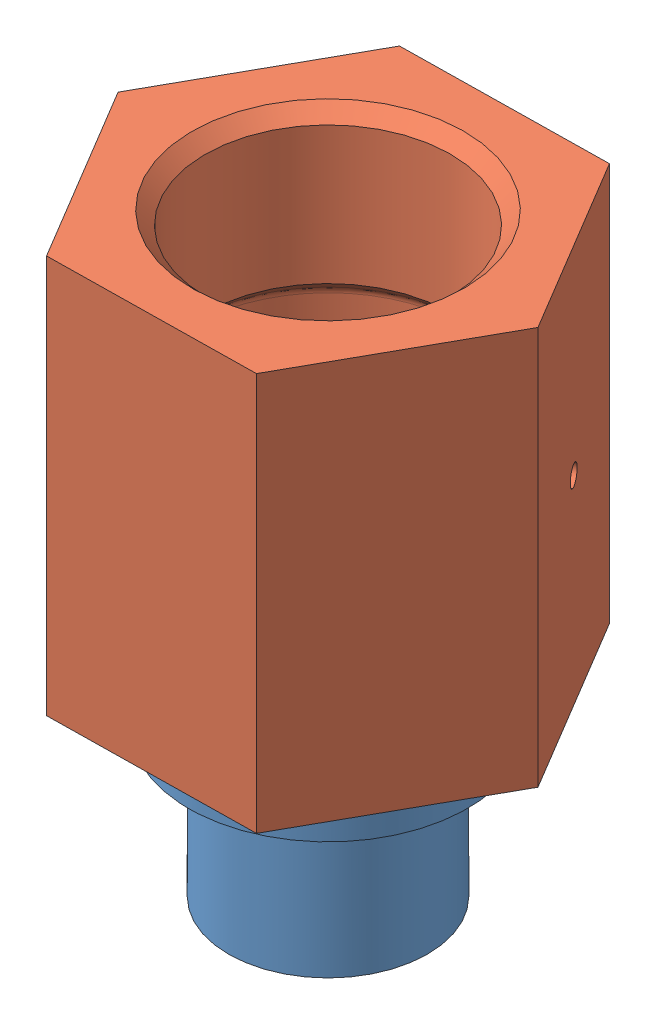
SolidWorks assembly Sestava5.sldasm, configuration Výchozí (file format 4700). Lengths in mm.
Overall size (31.57 44.82 27.46).
2 component instances, 2 part files, 1 mates.
Components (placement in the parent):
- Koncovka 40-1: Koncovka 40.SLDPRT [Výchozí] at origin size (21 24 21)
- Matice 40-1: Matice 40.SLDPRT [Výchozí] at (0 14.8222 0) x (0.99989 0 -0.014866) z (0.014866 0 0.99989) size (31.18 30 27)
Mates (geometry in assembly coordinates):
- Soustředná1: concentric anti-aligned: cylinder of Koncovka 40-1 through (0 24 0) axis (0 -1 0) radius 10.5; cylinder of Matice 40-1 through (0 14.8222 0) axis (0 1 0) radius 9.25
